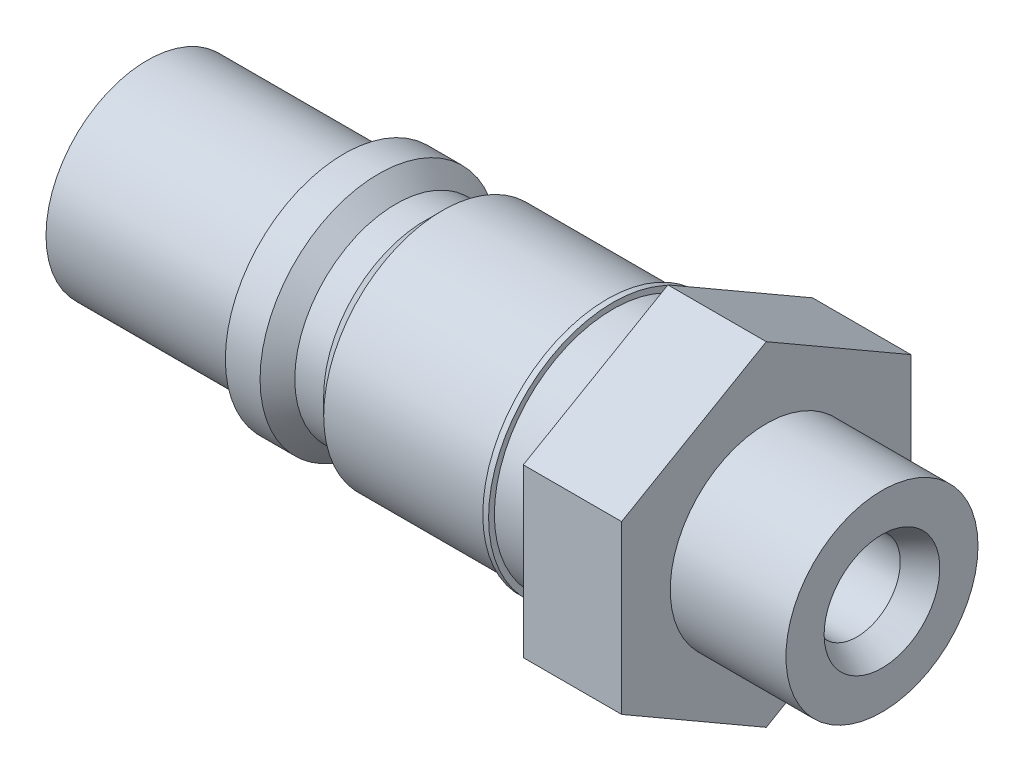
from build123d import *

# Parameters (mm, degrees)
SALIENTE_EXTRUIR2_DEPTH = 17
CROQUIS5_R              = 16.6
SALIENTE_EXTRUIR3_DEPTH = 20


with BuildPart() as part:
    # Croquis1 → Revoluci_n1 (revolve)
    with BuildSketch(Plane.XY, mode=Mode.PRIVATE) as revoluci_n1_sk:
        Polygon((0, 0), (0, 17.5), (34, 17.5), (34, 20.5), (40, 20.5), (43, 17.5), (48, 17.5), (51, 20.5), (79.5, 20.5), (79.5, 21.5), (80.5, 21.5), (80.5, 20.5), (90, 20.5), (90, 0), align=None)
    revolve(revoluci_n1_sk.sketch.rotate(Axis((0, 0, 0), (1, 0, 0)), 90), axis=Axis((0, 0, 0), (1, 0, 0)))

    # Croquis4 → Saliente-Extruir2 (add)
    with BuildSketch(Plane(origin=(90, 0, 0), x_dir=(0, 0, -1), z_dir=(1, 0, 0))):
        Polygon((0, 28.867513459), (-25, 14.43375673), (-25, -14.43375673), (0, -28.867513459), (25, -14.43375673), (25, 14.43375673), align=None)
    extrude(amount=SALIENTE_EXTRUIR2_DEPTH)

    # Croquis5 → Saliente-Extruir3 (add)
    with BuildSketch(Plane(origin=(107, 0, 0), x_dir=(0, 0, -1), z_dir=(1, 0, 0))):
        Circle(CROQUIS5_R)
    extrude(amount=SALIENTE_EXTRUIR3_DEPTH)

    # Croquis6 → Cortar-Revoluci_n1 (revolve, cut)
    with BuildSketch(Plane.XY, mode=Mode.PRIVATE) as cortar_revoluci_n1_sk:
        Polygon((0, 0), (0, 7.5), (122.669872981, 7.5), (127, 10), (127, 0), align=None)
    revolve(cortar_revoluci_n1_sk.sketch.rotate(Axis((0, 0, 0), (1, 0, 0)), 90), axis=Axis((0, 0, 0), (1, 0, 0)), mode=Mode.SUBTRACT)


solid = part.part
